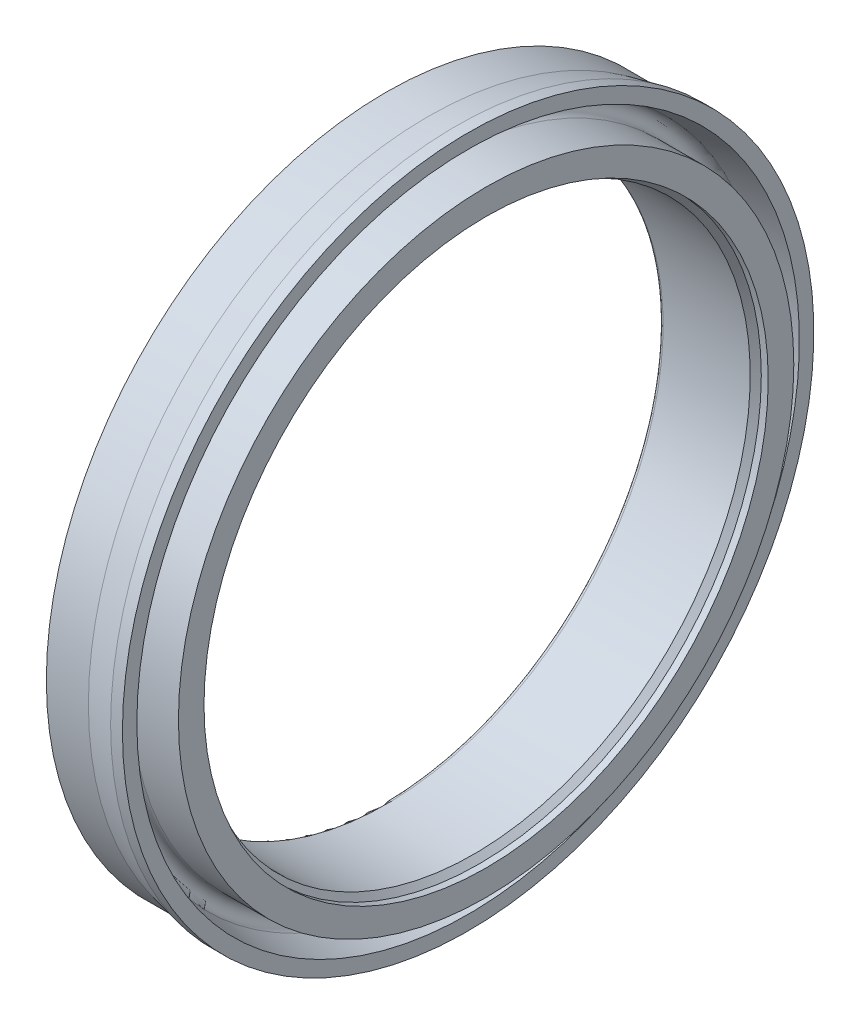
ISO-10303-21;
HEADER;
FILE_DESCRIPTION(('STEP AP214'),'2;1');
FILE_NAME('part.step','',(''),(''),'','','');
FILE_SCHEMA(('AUTOMOTIVE_DESIGN { 1 0 10303 214 1 1 1 1 }'));
ENDSEC;
DATA;
#1=APPLICATION_CONTEXT('core data for automotive mechanical design processes');
#2=APPLICATION_PROTOCOL_DEFINITION('international standard','automotive_design',2000,#1);
#3=PRODUCT_CONTEXT('',#1,'mechanical');
#4=PRODUCT('Part','Part','',(#3));
#5=PRODUCT_RELATED_PRODUCT_CATEGORY('part','',(#4));
#6=PRODUCT_DEFINITION_FORMATION('','',#4);
#7=PRODUCT_DEFINITION_CONTEXT('part definition',#1,'design');
#8=PRODUCT_DEFINITION('design','',#6,#7);
#9=PRODUCT_DEFINITION_SHAPE('','',#8);
#10=(LENGTH_UNIT() NAMED_UNIT(*) SI_UNIT(.MILLI.,.METRE.));
#11=(NAMED_UNIT(*) PLANE_ANGLE_UNIT() SI_UNIT($,.RADIAN.));
#12=(NAMED_UNIT(*) SI_UNIT($,.STERADIAN.) SOLID_ANGLE_UNIT());
#13=UNCERTAINTY_MEASURE_WITH_UNIT(LENGTH_MEASURE(1.E-05),#10,'distance_accuracy_value','');
#14=(GEOMETRIC_REPRESENTATION_CONTEXT(3) GLOBAL_UNCERTAINTY_ASSIGNED_CONTEXT((#13)) GLOBAL_UNIT_ASSIGNED_CONTEXT((#10,
#11,#12)) REPRESENTATION_CONTEXT('',''));
#15=CARTESIAN_POINT('',(0.,0.,0.));
#16=DIRECTION('',(0.,0.,1.));
#17=DIRECTION('',(1.,0.,0.));
#18=AXIS2_PLACEMENT_3D('',#15,#16,#17);
#19=CARTESIAN_POINT('',(562.739263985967,417.56369012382,0.));
#20=DIRECTION('',(-1.,0.,0.));
#21=DIRECTION('',(0.,0.,1.));
#22=AXIS2_PLACEMENT_3D('',#19,#20,#21);
#23=CYLINDRICAL_SURFACE('',#22,25.);
#24=CARTESIAN_POINT('',(589.76771210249,417.56369012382,0.));
#25=DIRECTION('',(-1.,0.,0.));
#26=DIRECTION('',(0.,0.,1.));
#27=AXIS2_PLACEMENT_3D('',#24,#25,#26);
#28=CIRCLE('',#27,25.);
#29=CARTESIAN_POINT('',(589.76771210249,417.56369012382,25.));
#30=VERTEX_POINT('',#29);
#31=EDGE_CURVE('E392',#30,#30,#28,.T.);
#32=ORIENTED_EDGE('',*,*,#31,.F.);
#33=EDGE_LOOP('',(#32));
#34=FACE_BOUND('',#33,.T.);
#35=CARTESIAN_POINT('',(590.621248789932,417.56369012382,0.));
#36=DIRECTION('',(-1.,0.,0.));
#37=DIRECTION('',(0.,0.,1.));
#38=AXIS2_PLACEMENT_3D('',#35,#36,#37);
#39=CIRCLE('',#38,25.);
#40=CARTESIAN_POINT('',(590.621248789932,417.56369012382,25.));
#41=VERTEX_POINT('',#40);
#42=EDGE_CURVE('E10',#41,#41,#39,.T.);
#43=ORIENTED_EDGE('',*,*,#42,.T.);
#44=EDGE_LOOP('',(#43));
#45=FACE_BOUND('',#44,.T.);
#46=ADVANCED_FACE('F346',(#34,#45),#23,.T.);
#47=CARTESIAN_POINT('',(590.621248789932,442.56369012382,0.));
#48=DIRECTION('',(-1.,0.,0.));
#49=DIRECTION('',(0.,0.,1.));
#50=AXIS2_PLACEMENT_3D('',#47,#48,#49);
#51=PLANE('',#50);
#52=ORIENTED_EDGE('',*,*,#42,.F.);
#53=EDGE_LOOP('',(#52));
#54=FACE_BOUND('',#53,.T.);
#55=CARTESIAN_POINT('',(590.621248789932,417.56369012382,0.));
#56=DIRECTION('',(-1.,0.,0.));
#57=DIRECTION('',(0.,0.,1.));
#58=AXIS2_PLACEMENT_3D('',#55,#56,#57);
#59=CIRCLE('',#58,23.9570675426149);
#60=CARTESIAN_POINT('',(590.621248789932,417.56369012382,23.9570675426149));
#61=VERTEX_POINT('',#60);
#62=EDGE_CURVE('E352',#61,#61,#59,.T.);
#63=ORIENTED_EDGE('',*,*,#62,.T.);
#64=EDGE_LOOP('',(#63));
#65=FACE_BOUND('',#64,.T.);
#66=ADVANCED_FACE('F399',(#54,#65),#51,.F.);
#67=CARTESIAN_POINT('',(588.410896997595,417.56369012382,0.));
#68=DIRECTION('',(1.,0.,0.));
#69=DIRECTION('',(0.,0.,-1.));
#70=AXIS2_PLACEMENT_3D('',#67,#68,#69);
#71=CONICAL_SURFACE('',#70,23.4782382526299,0.213333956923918);
#72=ORIENTED_EDGE('',*,*,#62,.F.);
#73=EDGE_LOOP('',(#72));
#74=FACE_BOUND('',#73,.T.);
#75=CARTESIAN_POINT('',(588.410896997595,417.56369012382,0.));
#76=DIRECTION('',(-1.,0.,0.));
#77=DIRECTION('',(0.,0.,1.));
#78=AXIS2_PLACEMENT_3D('',#75,#76,#77);
#79=CIRCLE('',#78,23.4782382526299);
#80=CARTESIAN_POINT('',(588.410896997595,417.56369012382,23.4782382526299));
#81=VERTEX_POINT('',#80);
#82=EDGE_CURVE('E356',#81,#81,#79,.T.);
#83=ORIENTED_EDGE('',*,*,#82,.T.);
#84=EDGE_LOOP('',(#83));
#85=FACE_BOUND('',#84,.T.);
#86=ADVANCED_FACE('F403',(#74,#85),#71,.F.);
#87=CARTESIAN_POINT('',(588.542408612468,417.56369012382,0.));
#88=DIRECTION('',(-1.,0.,0.));
#89=DIRECTION('',(0.,0.,1.));
#90=AXIS2_PLACEMENT_3D('',#87,#88,#89);
#91=TOROIDAL_SURFACE('',#90,22.8711598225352,0.621159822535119);
#92=ORIENTED_EDGE('',*,*,#82,.F.);
#93=EDGE_LOOP('',(#92));
#94=FACE_BOUND('',#93,.T.);
#95=CARTESIAN_POINT('',(588.542408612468,417.56369012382,0.));
#96=DIRECTION('',(-1.,0.,0.));
#97=DIRECTION('',(0.,0.,1.));
#98=AXIS2_PLACEMENT_3D('',#95,#96,#97);
#99=CIRCLE('',#98,22.2500000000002);
#100=CARTESIAN_POINT('',(588.542408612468,417.56369012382,22.2500000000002));
#101=VERTEX_POINT('',#100);
#102=EDGE_CURVE('E360',#101,#101,#99,.T.);
#103=ORIENTED_EDGE('',*,*,#102,.T.);
#104=EDGE_LOOP('',(#103));
#105=FACE_BOUND('',#104,.T.);
#106=ADVANCED_FACE('F408',(#94,#105),#91,.F.);
#107=CARTESIAN_POINT('',(562.739263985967,417.56369012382,0.));
#108=DIRECTION('',(-1.,0.,0.));
#109=DIRECTION('',(0.,0.,1.));
#110=AXIS2_PLACEMENT_3D('',#107,#108,#109);
#111=CYLINDRICAL_SURFACE('',#110,22.2500000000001);
#112=ORIENTED_EDGE('',*,*,#102,.F.);
#113=EDGE_LOOP('',(#112));
#114=FACE_BOUND('',#113,.T.);
#115=CARTESIAN_POINT('',(591.921248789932,417.56369012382,0.));
#116=DIRECTION('',(-1.,0.,0.));
#117=DIRECTION('',(0.,0.,1.));
#118=AXIS2_PLACEMENT_3D('',#115,#116,#117);
#119=CIRCLE('',#118,22.25);
#120=CARTESIAN_POINT('',(591.921248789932,417.56369012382,22.25));
#121=VERTEX_POINT('',#120);
#122=EDGE_CURVE('E365',#121,#121,#119,.T.);
#123=ORIENTED_EDGE('',*,*,#122,.T.);
#124=EDGE_LOOP('',(#123));
#125=FACE_BOUND('',#124,.T.);
#126=ADVANCED_FACE('F414',(#114,#125),#111,.T.);
#127=CARTESIAN_POINT('',(591.921248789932,437.96369012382,0.));
#128=DIRECTION('',(-1.,0.,0.));
#129=DIRECTION('',(0.,0.,1.));
#130=AXIS2_PLACEMENT_3D('',#127,#128,#129);
#131=PLANE('',#130);
#132=ORIENTED_EDGE('',*,*,#122,.F.);
#133=EDGE_LOOP('',(#132));
#134=FACE_BOUND('',#133,.T.);
#135=CARTESIAN_POINT('',(591.921248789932,417.56369012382,0.));
#136=DIRECTION('',(-1.,0.,0.));
#137=DIRECTION('',(0.,0.,1.));
#138=AXIS2_PLACEMENT_3D('',#135,#136,#137);
#139=CIRCLE('',#138,20.4);
#140=CARTESIAN_POINT('',(591.921248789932,417.56369012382,20.4));
#141=VERTEX_POINT('',#140);
#142=EDGE_CURVE('E368',#141,#141,#139,.T.);
#143=ORIENTED_EDGE('',*,*,#142,.T.);
#144=EDGE_LOOP('',(#143));
#145=FACE_BOUND('',#144,.T.);
#146=ADVANCED_FACE('F418',(#134,#145),#131,.F.);
#147=CARTESIAN_POINT('',(562.739263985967,417.56369012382,0.));
#148=DIRECTION('',(-1.,0.,0.));
#149=DIRECTION('',(0.,0.,1.));
#150=AXIS2_PLACEMENT_3D('',#147,#148,#149);
#151=CYLINDRICAL_SURFACE('',#150,20.4);
#152=ORIENTED_EDGE('',*,*,#142,.F.);
#153=EDGE_LOOP('',(#152));
#154=FACE_BOUND('',#153,.T.);
#155=CARTESIAN_POINT('',(591.421248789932,417.56369012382,0.));
#156=DIRECTION('',(-1.,0.,0.));
#157=DIRECTION('',(0.,0.,1.));
#158=AXIS2_PLACEMENT_3D('',#155,#156,#157);
#159=CIRCLE('',#158,20.4);
#160=CARTESIAN_POINT('',(591.421248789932,417.56369012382,20.4));
#161=VERTEX_POINT('',#160);
#162=EDGE_CURVE('E371',#161,#161,#159,.T.);
#163=ORIENTED_EDGE('',*,*,#162,.T.);
#164=EDGE_LOOP('',(#163));
#165=FACE_BOUND('',#164,.T.);
#166=ADVANCED_FACE('F422',(#154,#165),#151,.F.);
#167=CARTESIAN_POINT('',(591.021248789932,417.56369012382,0.));
#168=DIRECTION('',(1.,0.,0.));
#169=DIRECTION('',(0.,0.,-1.));
#170=AXIS2_PLACEMENT_3D('',#167,#168,#169);
#171=CONICAL_SURFACE('',#170,20.,0.785398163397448);
#172=ORIENTED_EDGE('',*,*,#162,.F.);
#173=EDGE_LOOP('',(#172));
#174=FACE_BOUND('',#173,.T.);
#175=CARTESIAN_POINT('',(591.021248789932,417.56369012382,0.));
#176=DIRECTION('',(-1.,0.,0.));
#177=DIRECTION('',(0.,0.,1.));
#178=AXIS2_PLACEMENT_3D('',#175,#176,#177);
#179=CIRCLE('',#178,20.);
#180=CARTESIAN_POINT('',(591.021248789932,417.56369012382,20.));
#181=VERTEX_POINT('',#180);
#182=EDGE_CURVE('E374',#181,#181,#179,.T.);
#183=ORIENTED_EDGE('',*,*,#182,.T.);
#184=EDGE_LOOP('',(#183));
#185=FACE_BOUND('',#184,.T.);
#186=ADVANCED_FACE('F426',(#174,#185),#171,.F.);
#187=CARTESIAN_POINT('',(562.739263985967,417.56369012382,0.));
#188=DIRECTION('',(-1.,0.,0.));
#189=DIRECTION('',(0.,0.,1.));
#190=AXIS2_PLACEMENT_3D('',#187,#188,#189);
#191=CYLINDRICAL_SURFACE('',#190,20.);
#192=ORIENTED_EDGE('',*,*,#182,.F.);
#193=EDGE_LOOP('',(#192));
#194=FACE_BOUND('',#193,.T.);
#195=CARTESIAN_POINT('',(584.721248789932,417.56369012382,0.));
#196=DIRECTION('',(-1.,0.,0.));
#197=DIRECTION('',(0.,0.,1.));
#198=AXIS2_PLACEMENT_3D('',#195,#196,#197);
#199=CIRCLE('',#198,20.);
#200=CARTESIAN_POINT('',(584.721248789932,417.56369012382,20.));
#201=VERTEX_POINT('',#200);
#202=EDGE_CURVE('E377',#201,#201,#199,.T.);
#203=ORIENTED_EDGE('',*,*,#202,.T.);
#204=EDGE_LOOP('',(#203));
#205=FACE_BOUND('',#204,.T.);
#206=ADVANCED_FACE('F430',(#194,#205),#191,.F.);
#207=CARTESIAN_POINT('',(584.721248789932,417.56369012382,0.));
#208=DIRECTION('',(-1.,0.,0.));
#209=DIRECTION('',(0.,0.,1.));
#210=AXIS2_PLACEMENT_3D('',#207,#208,#209);
#211=TOROIDAL_SURFACE('',#210,20.2999999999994,0.299999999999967);
#212=ORIENTED_EDGE('',*,*,#202,.F.);
#213=EDGE_LOOP('',(#212));
#214=FACE_BOUND('',#213,.T.);
#215=CARTESIAN_POINT('',(584.421248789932,417.56369012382,0.));
#216=DIRECTION('',(-1.,0.,0.));
#217=DIRECTION('',(0.,0.,1.));
#218=AXIS2_PLACEMENT_3D('',#215,#216,#217);
#219=CIRCLE('',#218,20.2999999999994);
#220=CARTESIAN_POINT('',(584.421248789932,417.56369012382,20.2999999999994));
#221=VERTEX_POINT('',#220);
#222=EDGE_CURVE('E380',#221,#221,#219,.T.);
#223=ORIENTED_EDGE('',*,*,#222,.T.);
#224=EDGE_LOOP('',(#223));
#225=FACE_BOUND('',#224,.T.);
#226=ADVANCED_FACE('F434',(#214,#225),#211,.T.);
#227=CARTESIAN_POINT('',(584.421248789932,441.46369012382,0.));
#228=DIRECTION('',(1.,0.,0.));
#229=DIRECTION('',(0.,0.,-1.));
#230=AXIS2_PLACEMENT_3D('',#227,#228,#229);
#231=PLANE('',#230);
#232=ORIENTED_EDGE('',*,*,#222,.F.);
#233=EDGE_LOOP('',(#232));
#234=FACE_BOUND('',#233,.T.);
#235=CARTESIAN_POINT('',(584.421248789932,417.56369012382,0.));
#236=DIRECTION('',(-1.,0.,0.));
#237=DIRECTION('',(0.,0.,1.));
#238=AXIS2_PLACEMENT_3D('',#235,#236,#237);
#239=CIRCLE('',#238,23.9);
#240=CARTESIAN_POINT('',(584.421248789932,417.56369012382,23.9));
#241=VERTEX_POINT('',#240);
#242=EDGE_CURVE('E383',#241,#241,#239,.T.);
#243=ORIENTED_EDGE('',*,*,#242,.T.);
#244=EDGE_LOOP('',(#243));
#245=FACE_BOUND('',#244,.T.);
#246=ADVANCED_FACE('F438',(#234,#245),#231,.F.);
#247=CARTESIAN_POINT('',(584.676027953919,417.56369012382,0.));
#248=DIRECTION('',(1.,0.,0.));
#249=DIRECTION('',(0.,0.,-1.));
#250=AXIS2_PLACEMENT_3D('',#247,#248,#249);
#251=CONICAL_SURFACE('',#250,24.5557332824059,1.20020739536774);
#252=ORIENTED_EDGE('',*,*,#242,.F.);
#253=EDGE_LOOP('',(#252));
#254=FACE_BOUND('',#253,.T.);
#255=CARTESIAN_POINT('',(584.676027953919,417.56369012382,0.));
#256=DIRECTION('',(-1.,0.,0.));
#257=DIRECTION('',(0.,0.,1.));
#258=AXIS2_PLACEMENT_3D('',#255,#256,#257);
#259=CIRCLE('',#258,24.5557332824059);
#260=CARTESIAN_POINT('',(584.676027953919,417.56369012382,24.5557332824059));
#261=VERTEX_POINT('',#260);
#262=EDGE_CURVE('E386',#261,#261,#259,.T.);
#263=ORIENTED_EDGE('',*,*,#262,.T.);
#264=EDGE_LOOP('',(#263));
#265=FACE_BOUND('',#264,.T.);
#266=ADVANCED_FACE('F442',(#254,#265),#251,.T.);
#267=CARTESIAN_POINT('',(562.739263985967,417.56369012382,0.));
#268=DIRECTION('',(-1.,0.,0.));
#269=DIRECTION('',(0.,0.,1.));
#270=AXIS2_PLACEMENT_3D('',#267,#268,#269);
#271=CYLINDRICAL_SURFACE('',#270,24.5557332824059);
#272=ORIENTED_EDGE('',*,*,#262,.F.);
#273=EDGE_LOOP('',(#272));
#274=FACE_BOUND('',#273,.T.);
#275=CARTESIAN_POINT('',(587.71690661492,417.56369012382,0.));
#276=DIRECTION('',(-1.,0.,0.));
#277=DIRECTION('',(0.,0.,1.));
#278=AXIS2_PLACEMENT_3D('',#275,#276,#277);
#279=CIRCLE('',#278,24.5557332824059);
#280=CARTESIAN_POINT('',(587.71690661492,417.56369012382,24.5557332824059));
#281=VERTEX_POINT('',#280);
#282=EDGE_CURVE('E389',#281,#281,#279,.T.);
#283=ORIENTED_EDGE('',*,*,#282,.T.);
#284=EDGE_LOOP('',(#283));
#285=FACE_BOUND('',#284,.T.);
#286=ADVANCED_FACE('F446',(#274,#285),#271,.T.);
#287=CARTESIAN_POINT('',(589.76771210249,417.56369012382,0.));
#288=DIRECTION('',(1.,0.,0.));
#289=DIRECTION('',(0.,0.,-1.));
#290=AXIS2_PLACEMENT_3D('',#287,#288,#289);
#291=CONICAL_SURFACE('',#290,25.,0.213333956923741);
#292=ORIENTED_EDGE('',*,*,#282,.F.);
#293=EDGE_LOOP('',(#292));
#294=FACE_BOUND('',#293,.T.);
#295=ORIENTED_EDGE('',*,*,#31,.T.);
#296=EDGE_LOOP('',(#295));
#297=FACE_BOUND('',#296,.T.);
#298=ADVANCED_FACE('F396',(#294,#297),#291,.T.);
#299=CLOSED_SHELL('',(#46,#66,#86,#106,#126,#146,#166,#186,#206,#226,#246,#266,#286,#298));
#300=MANIFOLD_SOLID_BREP('B2',#299);
#301=ADVANCED_BREP_SHAPE_REPRESENTATION('',(#18,#300),#14);
#302=SHAPE_DEFINITION_REPRESENTATION(#9,#301);
ENDSEC;
END-ISO-10303-21;
